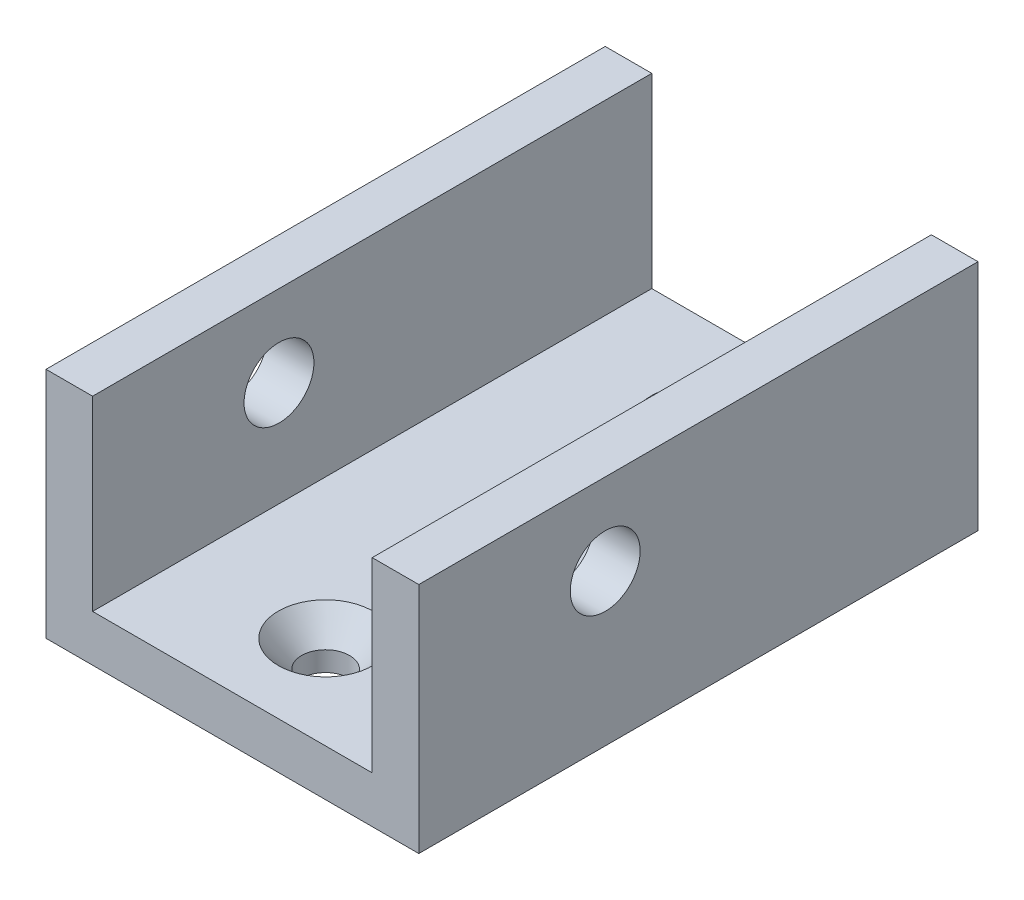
ISO-10303-21;
HEADER;
FILE_DESCRIPTION(('STEP AP214'),'2;1');
FILE_NAME('part.step','',(''),(''),'','','');
FILE_SCHEMA(('AUTOMOTIVE_DESIGN { 1 0 10303 214 1 1 1 1 }'));
ENDSEC;
DATA;
#1=APPLICATION_CONTEXT('core data for automotive mechanical design processes');
#2=APPLICATION_PROTOCOL_DEFINITION('international standard','automotive_design',2000,#1);
#3=PRODUCT_CONTEXT('',#1,'mechanical');
#4=PRODUCT('Part','Part','',(#3));
#5=PRODUCT_RELATED_PRODUCT_CATEGORY('part','',(#4));
#6=PRODUCT_DEFINITION_FORMATION('','',#4);
#7=PRODUCT_DEFINITION_CONTEXT('part definition',#1,'design');
#8=PRODUCT_DEFINITION('design','',#6,#7);
#9=PRODUCT_DEFINITION_SHAPE('','',#8);
#10=(LENGTH_UNIT() NAMED_UNIT(*) SI_UNIT(.MILLI.,.METRE.));
#11=(NAMED_UNIT(*) PLANE_ANGLE_UNIT() SI_UNIT($,.RADIAN.));
#12=(NAMED_UNIT(*) SI_UNIT($,.STERADIAN.) SOLID_ANGLE_UNIT());
#13=UNCERTAINTY_MEASURE_WITH_UNIT(LENGTH_MEASURE(1.E-05),#10,'distance_accuracy_value','');
#14=(GEOMETRIC_REPRESENTATION_CONTEXT(3) GLOBAL_UNCERTAINTY_ASSIGNED_CONTEXT((#13)) GLOBAL_UNIT_ASSIGNED_CONTEXT((#10,
#11,#12)) REPRESENTATION_CONTEXT('',''));
#15=CARTESIAN_POINT('',(0.,0.,0.));
#16=DIRECTION('',(0.,0.,1.));
#17=DIRECTION('',(1.,0.,0.));
#18=AXIS2_PLACEMENT_3D('',#15,#16,#17);
#19=CARTESIAN_POINT('',(25.4,0.,38.1));
#20=DIRECTION('',(-1.,0.,0.));
#21=DIRECTION('',(0.,-1.,0.));
#22=AXIS2_PLACEMENT_3D('',#19,#20,#21);
#23=PLANE('',#22);
#24=DIRECTION('',(0.,1.,0.));
#25=VECTOR('',#24,1.);
#26=CARTESIAN_POINT('',(25.4,0.,-38.1));
#27=LINE('',#26,#25);
#28=CARTESIAN_POINT('',(25.4,0.,-38.1));
#29=VERTEX_POINT('',#28);
#30=CARTESIAN_POINT('',(25.4,31.75,-38.1));
#31=VERTEX_POINT('',#30);
#32=EDGE_CURVE('E155',#29,#31,#27,.T.);
#33=ORIENTED_EDGE('',*,*,#32,.T.);
#34=DIRECTION('',(0.,0.,-1.));
#35=VECTOR('',#34,1.);
#36=CARTESIAN_POINT('',(25.4,31.75,38.1));
#37=LINE('',#36,#35);
#38=CARTESIAN_POINT('',(25.4,31.75,38.1));
#39=VERTEX_POINT('',#38);
#40=EDGE_CURVE('E171',#39,#31,#37,.T.);
#41=ORIENTED_EDGE('',*,*,#40,.F.);
#42=DIRECTION('',(0.,1.,0.));
#43=VECTOR('',#42,1.);
#44=CARTESIAN_POINT('',(25.4,0.,38.1));
#45=LINE('',#44,#43);
#46=CARTESIAN_POINT('',(25.4,0.,38.1));
#47=VERTEX_POINT('',#46);
#48=EDGE_CURVE('E180',#47,#39,#45,.T.);
#49=ORIENTED_EDGE('',*,*,#48,.F.);
#50=DIRECTION('',(0.,0.,-1.));
#51=VECTOR('',#50,1.);
#52=CARTESIAN_POINT('',(25.4,0.,38.1));
#53=LINE('',#52,#51);
#54=EDGE_CURVE('E61',#47,#29,#53,.T.);
#55=ORIENTED_EDGE('',*,*,#54,.T.);
#56=EDGE_LOOP('',(#33,#41,#49,#55));
#57=FACE_BOUND('',#56,.T.);
#58=CARTESIAN_POINT('',(25.4,20.6375,12.7));
#59=DIRECTION('',(1.,0.,0.));
#60=DIRECTION('',(0.,0.,-1.));
#61=AXIS2_PLACEMENT_3D('',#58,#59,#60);
#62=CIRCLE('',#61,4.7625);
#63=CARTESIAN_POINT('',(25.4,20.6375,7.93750000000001));
#64=VERTEX_POINT('',#63);
#65=EDGE_CURVE('E203',#64,#64,#62,.T.);
#66=ORIENTED_EDGE('',*,*,#65,.F.);
#67=EDGE_LOOP('',(#66));
#68=FACE_BOUND('',#67,.T.);
#69=ADVANCED_FACE('F51',(#57,#68),#23,.F.);
#70=CARTESIAN_POINT('',(-25.4,0.,38.1));
#71=DIRECTION('',(1.,0.,0.));
#72=DIRECTION('',(0.,0.,-1.));
#73=AXIS2_PLACEMENT_3D('',#70,#71,#72);
#74=PLANE('',#73);
#75=CARTESIAN_POINT('',(-25.4,20.6375,12.7));
#76=DIRECTION('',(1.,0.,0.));
#77=DIRECTION('',(0.,0.,-1.));
#78=AXIS2_PLACEMENT_3D('',#75,#76,#77);
#79=CIRCLE('',#78,4.76249999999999);
#80=CARTESIAN_POINT('',(-25.4,20.6375,7.93750000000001));
#81=VERTEX_POINT('',#80);
#82=EDGE_CURVE('E200',#81,#81,#79,.T.);
#83=ORIENTED_EDGE('',*,*,#82,.T.);
#84=EDGE_LOOP('',(#83));
#85=FACE_BOUND('',#84,.T.);
#86=DIRECTION('',(0.,-1.,0.));
#87=VECTOR('',#86,1.);
#88=CARTESIAN_POINT('',(-25.4,0.,-38.1));
#89=LINE('',#88,#87);
#90=CARTESIAN_POINT('',(-25.4,31.75,-38.1));
#91=VERTEX_POINT('',#90);
#92=CARTESIAN_POINT('',(-25.4,0.,-38.1));
#93=VERTEX_POINT('',#92);
#94=EDGE_CURVE('E149',#91,#93,#89,.T.);
#95=ORIENTED_EDGE('',*,*,#94,.T.);
#96=DIRECTION('',(0.,0.,-1.));
#97=VECTOR('',#96,1.);
#98=CARTESIAN_POINT('',(-25.4,0.,38.1));
#99=LINE('',#98,#97);
#100=CARTESIAN_POINT('',(-25.4,0.,38.1));
#101=VERTEX_POINT('',#100);
#102=EDGE_CURVE('E13',#101,#93,#99,.T.);
#103=ORIENTED_EDGE('',*,*,#102,.F.);
#104=DIRECTION('',(0.,-1.,0.));
#105=VECTOR('',#104,1.);
#106=CARTESIAN_POINT('',(-25.4,0.,38.1));
#107=LINE('',#106,#105);
#108=CARTESIAN_POINT('',(-25.4,31.75,38.1));
#109=VERTEX_POINT('',#108);
#110=EDGE_CURVE('E164',#109,#101,#107,.T.);
#111=ORIENTED_EDGE('',*,*,#110,.F.);
#112=DIRECTION('',(0.,0.,-1.));
#113=VECTOR('',#112,1.);
#114=CARTESIAN_POINT('',(-25.4,31.75,38.1));
#115=LINE('',#114,#113);
#116=EDGE_CURVE('E145',#109,#91,#115,.T.);
#117=ORIENTED_EDGE('',*,*,#116,.T.);
#118=EDGE_LOOP('',(#95,#103,#111,#117));
#119=FACE_BOUND('',#118,.T.);
#120=ADVANCED_FACE('F53',(#85,#119),#74,.F.);
#121=CARTESIAN_POINT('',(25.4,0.,38.1));
#122=DIRECTION('',(0.,1.,0.));
#123=DIRECTION('',(0.,0.,1.));
#124=AXIS2_PLACEMENT_3D('',#121,#122,#123);
#125=PLANE('',#124);
#126=CARTESIAN_POINT('',(0.,0.,-25.4));
#127=DIRECTION('',(0.,1.,0.));
#128=DIRECTION('',(0.,0.,1.));
#129=AXIS2_PLACEMENT_3D('',#126,#127,#128);
#130=CIRCLE('',#129,3.2639);
#131=CARTESIAN_POINT('',(0.,0.,-22.1361));
#132=VERTEX_POINT('',#131);
#133=EDGE_CURVE('E215',#132,#132,#130,.T.);
#134=ORIENTED_EDGE('',*,*,#133,.T.);
#135=EDGE_LOOP('',(#134));
#136=FACE_BOUND('',#135,.T.);
#137=CARTESIAN_POINT('',(0.,0.,25.4));
#138=DIRECTION('',(0.,1.,0.));
#139=DIRECTION('',(0.,0.,1.));
#140=AXIS2_PLACEMENT_3D('',#137,#138,#139);
#141=CIRCLE('',#140,3.2639);
#142=CARTESIAN_POINT('',(0.,0.,28.6639));
#143=VERTEX_POINT('',#142);
#144=EDGE_CURVE('E206',#143,#143,#141,.T.);
#145=ORIENTED_EDGE('',*,*,#144,.T.);
#146=EDGE_LOOP('',(#145));
#147=FACE_BOUND('',#146,.T.);
#148=DIRECTION('',(1.,0.,0.));
#149=VECTOR('',#148,1.);
#150=CARTESIAN_POINT('',(25.4,0.,-38.1));
#151=LINE('',#150,#149);
#152=EDGE_CURVE('E152',#93,#29,#151,.T.);
#153=ORIENTED_EDGE('',*,*,#152,.T.);
#154=ORIENTED_EDGE('',*,*,#54,.F.);
#155=DIRECTION('',(1.,0.,0.));
#156=VECTOR('',#155,1.);
#157=CARTESIAN_POINT('',(25.4,0.,38.1));
#158=LINE('',#157,#156);
#159=EDGE_CURVE('E112',#101,#47,#158,.T.);
#160=ORIENTED_EDGE('',*,*,#159,.F.);
#161=ORIENTED_EDGE('',*,*,#102,.T.);
#162=EDGE_LOOP('',(#153,#154,#160,#161));
#163=FACE_BOUND('',#162,.T.);
#164=ADVANCED_FACE('F253',(#136,#147,#163),#125,.F.);
#165=CARTESIAN_POINT('',(25.4,31.75,38.1));
#166=DIRECTION('',(0.,-1.,0.));
#167=DIRECTION('',(0.,0.,-1.));
#168=AXIS2_PLACEMENT_3D('',#165,#166,#167);
#169=PLANE('',#168);
#170=DIRECTION('',(-1.,0.,0.));
#171=VECTOR('',#170,1.);
#172=CARTESIAN_POINT('',(25.4,31.75,-38.1));
#173=LINE('',#172,#171);
#174=CARTESIAN_POINT('',(19.05,31.75,-38.1));
#175=VERTEX_POINT('',#174);
#176=EDGE_CURVE('E157',#31,#175,#173,.T.);
#177=ORIENTED_EDGE('',*,*,#176,.T.);
#178=DIRECTION('',(0.,0.,-1.));
#179=VECTOR('',#178,1.);
#180=CARTESIAN_POINT('',(19.05,31.75,38.1));
#181=LINE('',#180,#179);
#182=CARTESIAN_POINT('',(19.05,31.75,38.1));
#183=VERTEX_POINT('',#182);
#184=EDGE_CURVE('E168',#183,#175,#181,.T.);
#185=ORIENTED_EDGE('',*,*,#184,.F.);
#186=DIRECTION('',(-1.,0.,0.));
#187=VECTOR('',#186,1.);
#188=CARTESIAN_POINT('',(25.4,31.75,38.1));
#189=LINE('',#188,#187);
#190=EDGE_CURVE('E192',#39,#183,#189,.T.);
#191=ORIENTED_EDGE('',*,*,#190,.F.);
#192=ORIENTED_EDGE('',*,*,#40,.T.);
#193=EDGE_LOOP('',(#177,#185,#191,#192));
#194=FACE_BOUND('',#193,.T.);
#195=ADVANCED_FACE('F188',(#194),#169,.F.);
#196=CARTESIAN_POINT('',(19.05,31.75,38.1));
#197=DIRECTION('',(1.,0.,0.));
#198=DIRECTION('',(0.,1.,0.));
#199=AXIS2_PLACEMENT_3D('',#196,#197,#198);
#200=PLANE('',#199);
#201=CARTESIAN_POINT('',(19.05,20.6375,12.7));
#202=DIRECTION('',(1.,0.,0.));
#203=DIRECTION('',(0.,1.,0.));
#204=AXIS2_PLACEMENT_3D('',#201,#202,#203);
#205=CIRCLE('',#204,4.76249999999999);
#206=CARTESIAN_POINT('',(19.05,25.4,12.7));
#207=VERTEX_POINT('',#206);
#208=EDGE_CURVE('E55',#207,#207,#205,.T.);
#209=ORIENTED_EDGE('',*,*,#208,.T.);
#210=EDGE_LOOP('',(#209));
#211=FACE_BOUND('',#210,.T.);
#212=DIRECTION('',(0.,-1.,0.));
#213=VECTOR('',#212,1.);
#214=CARTESIAN_POINT('',(19.05,31.75,-38.1));
#215=LINE('',#214,#213);
#216=CARTESIAN_POINT('',(19.05,6.35,-38.1));
#217=VERTEX_POINT('',#216);
#218=EDGE_CURVE('E159',#175,#217,#215,.T.);
#219=ORIENTED_EDGE('',*,*,#218,.T.);
#220=DIRECTION('',(0.,0.,-1.));
#221=VECTOR('',#220,1.);
#222=CARTESIAN_POINT('',(19.05,6.35,38.1));
#223=LINE('',#222,#221);
#224=CARTESIAN_POINT('',(19.05,6.35,38.1));
#225=VERTEX_POINT('',#224);
#226=EDGE_CURVE('E140',#225,#217,#223,.T.);
#227=ORIENTED_EDGE('',*,*,#226,.F.);
#228=DIRECTION('',(0.,-1.,0.));
#229=VECTOR('',#228,1.);
#230=CARTESIAN_POINT('',(19.05,31.75,38.1));
#231=LINE('',#230,#229);
#232=EDGE_CURVE('E131',#183,#225,#231,.T.);
#233=ORIENTED_EDGE('',*,*,#232,.F.);
#234=ORIENTED_EDGE('',*,*,#184,.T.);
#235=EDGE_LOOP('',(#219,#227,#233,#234));
#236=FACE_BOUND('',#235,.T.);
#237=ADVANCED_FACE('F191',(#211,#236),#200,.F.);
#238=CARTESIAN_POINT('',(-19.05,6.34999999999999,38.1));
#239=DIRECTION('',(0.,-1.,0.));
#240=DIRECTION('',(1.,0.,0.));
#241=AXIS2_PLACEMENT_3D('',#238,#239,#240);
#242=PLANE('',#241);
#243=CARTESIAN_POINT('',(0.,6.35,-25.4));
#244=DIRECTION('',(0.,1.,0.));
#245=DIRECTION('',(0.,0.,1.));
#246=AXIS2_PLACEMENT_3D('',#243,#244,#245);
#247=CIRCLE('',#246,6.4389);
#248=CARTESIAN_POINT('',(0.,6.35,-18.9611));
#249=VERTEX_POINT('',#248);
#250=EDGE_CURVE('E221',#249,#249,#247,.T.);
#251=ORIENTED_EDGE('',*,*,#250,.F.);
#252=EDGE_LOOP('',(#251));
#253=FACE_BOUND('',#252,.T.);
#254=CARTESIAN_POINT('',(0.,6.35,25.4));
#255=DIRECTION('',(0.,1.,0.));
#256=DIRECTION('',(0.,0.,1.));
#257=AXIS2_PLACEMENT_3D('',#254,#255,#256);
#258=CIRCLE('',#257,6.4389);
#259=CARTESIAN_POINT('',(0.,6.35,31.8389));
#260=VERTEX_POINT('',#259);
#261=EDGE_CURVE('E212',#260,#260,#258,.T.);
#262=ORIENTED_EDGE('',*,*,#261,.F.);
#263=EDGE_LOOP('',(#262));
#264=FACE_BOUND('',#263,.T.);
#265=DIRECTION('',(-1.,0.,0.));
#266=VECTOR('',#265,1.);
#267=CARTESIAN_POINT('',(-19.05,6.34999999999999,-38.1));
#268=LINE('',#267,#266);
#269=CARTESIAN_POINT('',(-19.05,6.34999999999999,-38.1));
#270=VERTEX_POINT('',#269);
#271=EDGE_CURVE('E139',#217,#270,#268,.T.);
#272=ORIENTED_EDGE('',*,*,#271,.T.);
#273=DIRECTION('',(0.,0.,-1.));
#274=VECTOR('',#273,1.);
#275=CARTESIAN_POINT('',(-19.05,6.34999999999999,38.1));
#276=LINE('',#275,#274);
#277=CARTESIAN_POINT('',(-19.05,6.34999999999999,38.1));
#278=VERTEX_POINT('',#277);
#279=EDGE_CURVE('E136',#278,#270,#276,.T.);
#280=ORIENTED_EDGE('',*,*,#279,.F.);
#281=DIRECTION('',(-1.,0.,0.));
#282=VECTOR('',#281,1.);
#283=CARTESIAN_POINT('',(-19.05,6.34999999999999,38.1));
#284=LINE('',#283,#282);
#285=EDGE_CURVE('E125',#225,#278,#284,.T.);
#286=ORIENTED_EDGE('',*,*,#285,.F.);
#287=ORIENTED_EDGE('',*,*,#226,.T.);
#288=EDGE_LOOP('',(#272,#280,#286,#287));
#289=FACE_BOUND('',#288,.T.);
#290=ADVANCED_FACE('F137',(#253,#264,#289),#242,.F.);
#291=CARTESIAN_POINT('',(-19.05,31.75,38.1));
#292=DIRECTION('',(-1.,0.,0.));
#293=DIRECTION('',(0.,-1.,0.));
#294=AXIS2_PLACEMENT_3D('',#291,#292,#293);
#295=PLANE('',#294);
#296=CARTESIAN_POINT('',(-19.05,20.6375,12.7));
#297=DIRECTION('',(-1.,0.,0.));
#298=DIRECTION('',(0.,-1.,0.));
#299=AXIS2_PLACEMENT_3D('',#296,#297,#298);
#300=CIRCLE('',#299,4.76249999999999);
#301=CARTESIAN_POINT('',(-19.05,15.875,12.7));
#302=VERTEX_POINT('',#301);
#303=EDGE_CURVE('E153',#302,#302,#300,.T.);
#304=ORIENTED_EDGE('',*,*,#303,.T.);
#305=EDGE_LOOP('',(#304));
#306=FACE_BOUND('',#305,.T.);
#307=DIRECTION('',(0.,1.,0.));
#308=VECTOR('',#307,1.);
#309=CARTESIAN_POINT('',(-19.05,31.75,-38.1));
#310=LINE('',#309,#308);
#311=CARTESIAN_POINT('',(-19.05,31.75,-38.1));
#312=VERTEX_POINT('',#311);
#313=EDGE_CURVE('E98',#270,#312,#310,.T.);
#314=ORIENTED_EDGE('',*,*,#313,.T.);
#315=DIRECTION('',(0.,0.,-1.));
#316=VECTOR('',#315,1.);
#317=CARTESIAN_POINT('',(-19.05,31.75,38.1));
#318=LINE('',#317,#316);
#319=CARTESIAN_POINT('',(-19.05,31.75,38.1));
#320=VERTEX_POINT('',#319);
#321=EDGE_CURVE('E141',#320,#312,#318,.T.);
#322=ORIENTED_EDGE('',*,*,#321,.F.);
#323=DIRECTION('',(0.,1.,0.));
#324=VECTOR('',#323,1.);
#325=CARTESIAN_POINT('',(-19.05,31.75,38.1));
#326=LINE('',#325,#324);
#327=EDGE_CURVE('E129',#278,#320,#326,.T.);
#328=ORIENTED_EDGE('',*,*,#327,.F.);
#329=ORIENTED_EDGE('',*,*,#279,.T.);
#330=EDGE_LOOP('',(#314,#322,#328,#329));
#331=FACE_BOUND('',#330,.T.);
#332=ADVANCED_FACE('F143',(#306,#331),#295,.F.);
#333=CARTESIAN_POINT('',(-25.4,31.75,38.1));
#334=DIRECTION('',(0.,-1.,0.));
#335=DIRECTION('',(0.,0.,-1.));
#336=AXIS2_PLACEMENT_3D('',#333,#334,#335);
#337=PLANE('',#336);
#338=DIRECTION('',(-1.,0.,0.));
#339=VECTOR('',#338,1.);
#340=CARTESIAN_POINT('',(-25.4,31.75,-38.1));
#341=LINE('',#340,#339);
#342=EDGE_CURVE('E104',#312,#91,#341,.T.);
#343=ORIENTED_EDGE('',*,*,#342,.T.);
#344=ORIENTED_EDGE('',*,*,#116,.F.);
#345=DIRECTION('',(-1.,0.,0.));
#346=VECTOR('',#345,1.);
#347=CARTESIAN_POINT('',(-25.4,31.75,38.1));
#348=LINE('',#347,#346);
#349=EDGE_CURVE('E69',#320,#109,#348,.T.);
#350=ORIENTED_EDGE('',*,*,#349,.F.);
#351=ORIENTED_EDGE('',*,*,#321,.T.);
#352=EDGE_LOOP('',(#343,#344,#350,#351));
#353=FACE_BOUND('',#352,.T.);
#354=ADVANCED_FACE('F268',(#353),#337,.F.);
#355=CARTESIAN_POINT('',(0.,0.,38.1));
#356=DIRECTION('',(0.,0.,-1.));
#357=DIRECTION('',(-1.,0.,0.));
#358=AXIS2_PLACEMENT_3D('',#355,#356,#357);
#359=PLANE('',#358);
#360=ORIENTED_EDGE('',*,*,#110,.T.);
#361=ORIENTED_EDGE('',*,*,#159,.T.);
#362=ORIENTED_EDGE('',*,*,#48,.T.);
#363=ORIENTED_EDGE('',*,*,#190,.T.);
#364=ORIENTED_EDGE('',*,*,#232,.T.);
#365=ORIENTED_EDGE('',*,*,#285,.T.);
#366=ORIENTED_EDGE('',*,*,#327,.T.);
#367=ORIENTED_EDGE('',*,*,#349,.T.);
#368=EDGE_LOOP('',(#360,#361,#362,#363,#364,#365,#366,#367));
#369=FACE_BOUND('',#368,.T.);
#370=ADVANCED_FACE('F127',(#369),#359,.F.);
#371=CARTESIAN_POINT('',(0.,0.,-38.1));
#372=DIRECTION('',(0.,0.,-1.));
#373=DIRECTION('',(-1.,0.,0.));
#374=AXIS2_PLACEMENT_3D('',#371,#372,#373);
#375=PLANE('',#374);
#376=ORIENTED_EDGE('',*,*,#94,.F.);
#377=ORIENTED_EDGE('',*,*,#342,.F.);
#378=ORIENTED_EDGE('',*,*,#313,.F.);
#379=ORIENTED_EDGE('',*,*,#271,.F.);
#380=ORIENTED_EDGE('',*,*,#218,.F.);
#381=ORIENTED_EDGE('',*,*,#176,.F.);
#382=ORIENTED_EDGE('',*,*,#32,.F.);
#383=ORIENTED_EDGE('',*,*,#152,.F.);
#384=EDGE_LOOP('',(#376,#377,#378,#379,#380,#381,#382,#383));
#385=FACE_BOUND('',#384,.T.);
#386=ADVANCED_FACE('F184',(#385),#375,.T.);
#387=CARTESIAN_POINT('',(25.4,20.6375,12.7));
#388=DIRECTION('',(1.,0.,0.));
#389=DIRECTION('',(0.,0.,-1.));
#390=AXIS2_PLACEMENT_3D('',#387,#388,#389);
#391=CYLINDRICAL_SURFACE('',#390,4.76249999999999);
#392=ORIENTED_EDGE('',*,*,#65,.T.);
#393=EDGE_LOOP('',(#392));
#394=FACE_BOUND('',#393,.T.);
#395=ORIENTED_EDGE('',*,*,#208,.F.);
#396=EDGE_LOOP('',(#395));
#397=FACE_BOUND('',#396,.T.);
#398=ADVANCED_FACE('F286',(#394,#397),#391,.F.);
#399=ORIENTED_EDGE('',*,*,#82,.F.);
#400=EDGE_LOOP('',(#399));
#401=FACE_BOUND('',#400,.T.);
#402=ORIENTED_EDGE('',*,*,#303,.F.);
#403=EDGE_LOOP('',(#402));
#404=FACE_BOUND('',#403,.T.);
#405=ADVANCED_FACE('F244',(#401,#404),#391,.F.);
#406=CARTESIAN_POINT('',(0.,6.35,25.4));
#407=DIRECTION('',(0.,1.,0.));
#408=DIRECTION('',(0.,0.,1.));
#409=AXIS2_PLACEMENT_3D('',#406,#407,#408);
#410=CYLINDRICAL_SURFACE('',#409,3.2639);
#411=ORIENTED_EDGE('',*,*,#144,.F.);
#412=EDGE_LOOP('',(#411));
#413=FACE_BOUND('',#412,.T.);
#414=CARTESIAN_POINT('',(0.,2.69758030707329,25.4));
#415=DIRECTION('',(0.,1.,0.));
#416=DIRECTION('',(0.,0.,1.));
#417=AXIS2_PLACEMENT_3D('',#414,#415,#416);
#418=CIRCLE('',#417,3.2639);
#419=CARTESIAN_POINT('',(0.,2.69758030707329,28.6639));
#420=VERTEX_POINT('',#419);
#421=EDGE_CURVE('E209',#420,#420,#418,.T.);
#422=ORIENTED_EDGE('',*,*,#421,.T.);
#423=EDGE_LOOP('',(#422));
#424=FACE_BOUND('',#423,.T.);
#425=ADVANCED_FACE('F235',(#413,#424),#410,.F.);
#426=CARTESIAN_POINT('',(0.,6.35,25.4));
#427=DIRECTION('',(0.,1.,0.));
#428=DIRECTION('',(0.,0.,1.));
#429=AXIS2_PLACEMENT_3D('',#426,#427,#428);
#430=CONICAL_SURFACE('',#429,6.4389,0.715584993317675);
#431=ORIENTED_EDGE('',*,*,#421,.F.);
#432=EDGE_LOOP('',(#431));
#433=FACE_BOUND('',#432,.T.);
#434=ORIENTED_EDGE('',*,*,#261,.T.);
#435=EDGE_LOOP('',(#434));
#436=FACE_BOUND('',#435,.T.);
#437=ADVANCED_FACE('F232',(#433,#436),#430,.F.);
#438=CARTESIAN_POINT('',(0.,6.35,-25.4));
#439=DIRECTION('',(0.,1.,0.));
#440=DIRECTION('',(0.,0.,1.));
#441=AXIS2_PLACEMENT_3D('',#438,#439,#440);
#442=CYLINDRICAL_SURFACE('',#441,3.2639);
#443=ORIENTED_EDGE('',*,*,#133,.F.);
#444=EDGE_LOOP('',(#443));
#445=FACE_BOUND('',#444,.T.);
#446=CARTESIAN_POINT('',(0.,2.69758030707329,-25.4));
#447=DIRECTION('',(0.,1.,0.));
#448=DIRECTION('',(0.,0.,1.));
#449=AXIS2_PLACEMENT_3D('',#446,#447,#448);
#450=CIRCLE('',#449,3.2639);
#451=CARTESIAN_POINT('',(0.,2.69758030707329,-22.1361));
#452=VERTEX_POINT('',#451);
#453=EDGE_CURVE('E218',#452,#452,#450,.T.);
#454=ORIENTED_EDGE('',*,*,#453,.T.);
#455=EDGE_LOOP('',(#454));
#456=FACE_BOUND('',#455,.T.);
#457=ADVANCED_FACE('F234',(#445,#456),#442,.F.);
#458=CARTESIAN_POINT('',(0.,6.35,-25.4));
#459=DIRECTION('',(0.,1.,0.));
#460=DIRECTION('',(0.,0.,1.));
#461=AXIS2_PLACEMENT_3D('',#458,#459,#460);
#462=CONICAL_SURFACE('',#461,6.4389,0.715584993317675);
#463=ORIENTED_EDGE('',*,*,#453,.F.);
#464=EDGE_LOOP('',(#463));
#465=FACE_BOUND('',#464,.T.);
#466=ORIENTED_EDGE('',*,*,#250,.T.);
#467=EDGE_LOOP('',(#466));
#468=FACE_BOUND('',#467,.T.);
#469=ADVANCED_FACE('F225',(#465,#468),#462,.F.);
#470=CLOSED_SHELL('',(#69,#120,#164,#195,#237,#290,#332,#354,#370,#386,#398,#405,#425,#437,#457,#469));
#471=MANIFOLD_SOLID_BREP('B2',#470);
#472=ADVANCED_BREP_SHAPE_REPRESENTATION('',(#18,#471),#14);
#473=SHAPE_DEFINITION_REPRESENTATION(#9,#472);
ENDSEC;
END-ISO-10303-21;
